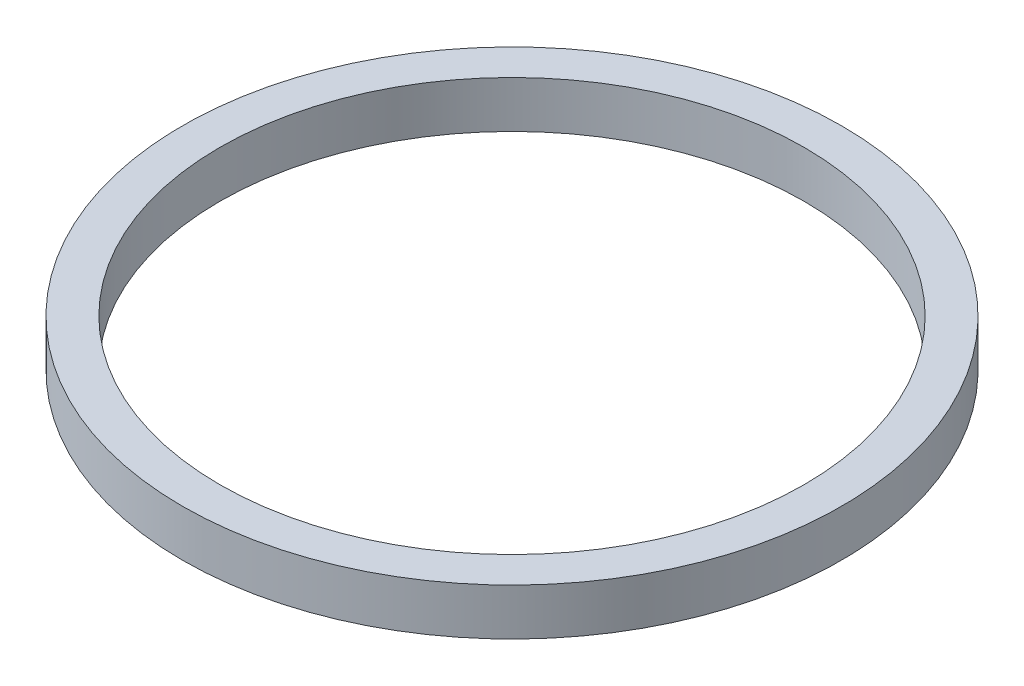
ISO-10303-21;
HEADER;
FILE_DESCRIPTION(('STEP AP214'),'2;1');
FILE_NAME('part.step','',(''),(''),'','','');
FILE_SCHEMA(('AUTOMOTIVE_DESIGN { 1 0 10303 214 1 1 1 1 }'));
ENDSEC;
DATA;
#1=APPLICATION_CONTEXT('core data for automotive mechanical design processes');
#2=APPLICATION_PROTOCOL_DEFINITION('international standard','automotive_design',2000,#1);
#3=PRODUCT_CONTEXT('',#1,'mechanical');
#4=PRODUCT('Part','Part','',(#3));
#5=PRODUCT_RELATED_PRODUCT_CATEGORY('part','',(#4));
#6=PRODUCT_DEFINITION_FORMATION('','',#4);
#7=PRODUCT_DEFINITION_CONTEXT('part definition',#1,'design');
#8=PRODUCT_DEFINITION('design','',#6,#7);
#9=PRODUCT_DEFINITION_SHAPE('','',#8);
#10=(LENGTH_UNIT() NAMED_UNIT(*) SI_UNIT(.MILLI.,.METRE.));
#11=(NAMED_UNIT(*) PLANE_ANGLE_UNIT() SI_UNIT($,.RADIAN.));
#12=(NAMED_UNIT(*) SI_UNIT($,.STERADIAN.) SOLID_ANGLE_UNIT());
#13=UNCERTAINTY_MEASURE_WITH_UNIT(LENGTH_MEASURE(1.E-05),#10,'distance_accuracy_value','');
#14=(GEOMETRIC_REPRESENTATION_CONTEXT(3) GLOBAL_UNCERTAINTY_ASSIGNED_CONTEXT((#13)) GLOBAL_UNIT_ASSIGNED_CONTEXT((#10,
#11,#12)) REPRESENTATION_CONTEXT('',''));
#15=CARTESIAN_POINT('',(0.,0.,0.));
#16=DIRECTION('',(0.,0.,1.));
#17=DIRECTION('',(1.,0.,0.));
#18=AXIS2_PLACEMENT_3D('',#15,#16,#17);
#19=CARTESIAN_POINT('',(0.,2.,0.));
#20=DIRECTION('',(0.,-1.,0.));
#21=DIRECTION('',(0.,0.,-1.));
#22=AXIS2_PLACEMENT_3D('',#19,#20,#21);
#23=CYLINDRICAL_SURFACE('',#22,14.1);
#24=CARTESIAN_POINT('',(0.,2.,0.));
#25=DIRECTION('',(0.,1.,0.));
#26=DIRECTION('',(0.,0.,1.));
#27=AXIS2_PLACEMENT_3D('',#24,#25,#26);
#28=CIRCLE('',#27,14.1);
#29=CARTESIAN_POINT('',(0.,2.,14.1));
#30=VERTEX_POINT('',#29);
#31=EDGE_CURVE('E10',#30,#30,#28,.T.);
#32=ORIENTED_EDGE('',*,*,#31,.F.);
#33=EDGE_LOOP('',(#32));
#34=FACE_BOUND('',#33,.T.);
#35=CARTESIAN_POINT('',(0.,0.,0.));
#36=DIRECTION('',(0.,1.,0.));
#37=DIRECTION('',(0.,0.,1.));
#38=AXIS2_PLACEMENT_3D('',#35,#36,#37);
#39=CIRCLE('',#38,14.1);
#40=CARTESIAN_POINT('',(0.,0.,14.1));
#41=VERTEX_POINT('',#40);
#42=EDGE_CURVE('E33',#41,#41,#39,.T.);
#43=ORIENTED_EDGE('',*,*,#42,.T.);
#44=EDGE_LOOP('',(#43));
#45=FACE_BOUND('',#44,.T.);
#46=ADVANCED_FACE('F30',(#34,#45),#23,.T.);
#47=CARTESIAN_POINT('',(0.,2.,0.));
#48=DIRECTION('',(0.,1.,0.));
#49=DIRECTION('',(0.,0.,1.));
#50=AXIS2_PLACEMENT_3D('',#47,#48,#49);
#51=PLANE('',#50);
#52=CARTESIAN_POINT('',(0.,2.,0.));
#53=DIRECTION('',(0.,1.,0.));
#54=DIRECTION('',(0.,0.,1.));
#55=AXIS2_PLACEMENT_3D('',#52,#53,#54);
#56=CIRCLE('',#55,12.5);
#57=CARTESIAN_POINT('',(0.,2.,12.5));
#58=VERTEX_POINT('',#57);
#59=EDGE_CURVE('E42',#58,#58,#56,.T.);
#60=ORIENTED_EDGE('',*,*,#59,.F.);
#61=EDGE_LOOP('',(#60));
#62=FACE_BOUND('',#61,.T.);
#63=ORIENTED_EDGE('',*,*,#31,.T.);
#64=EDGE_LOOP('',(#63));
#65=FACE_BOUND('',#64,.T.);
#66=ADVANCED_FACE('F57',(#62,#65),#51,.T.);
#67=CARTESIAN_POINT('',(0.,0.,0.));
#68=DIRECTION('',(0.,1.,0.));
#69=DIRECTION('',(0.,0.,1.));
#70=AXIS2_PLACEMENT_3D('',#67,#68,#69);
#71=PLANE('',#70);
#72=CARTESIAN_POINT('',(0.,0.,0.));
#73=DIRECTION('',(0.,1.,0.));
#74=DIRECTION('',(0.,0.,1.));
#75=AXIS2_PLACEMENT_3D('',#72,#73,#74);
#76=CIRCLE('',#75,12.5);
#77=CARTESIAN_POINT('',(0.,0.,12.5));
#78=VERTEX_POINT('',#77);
#79=EDGE_CURVE('E40',#78,#78,#76,.T.);
#80=ORIENTED_EDGE('',*,*,#79,.T.);
#81=EDGE_LOOP('',(#80));
#82=FACE_BOUND('',#81,.T.);
#83=ORIENTED_EDGE('',*,*,#42,.F.);
#84=EDGE_LOOP('',(#83));
#85=FACE_BOUND('',#84,.T.);
#86=ADVANCED_FACE('F48',(#82,#85),#71,.F.);
#87=CARTESIAN_POINT('',(0.,0.,0.));
#88=DIRECTION('',(0.,1.,0.));
#89=DIRECTION('',(0.,0.,1.));
#90=AXIS2_PLACEMENT_3D('',#87,#88,#89);
#91=CYLINDRICAL_SURFACE('',#90,12.5);
#92=ORIENTED_EDGE('',*,*,#79,.F.);
#93=EDGE_LOOP('',(#92));
#94=FACE_BOUND('',#93,.T.);
#95=ORIENTED_EDGE('',*,*,#59,.T.);
#96=EDGE_LOOP('',(#95));
#97=FACE_BOUND('',#96,.T.);
#98=ADVANCED_FACE('F51',(#94,#97),#91,.F.);
#99=CLOSED_SHELL('',(#46,#66,#86,#98));
#100=MANIFOLD_SOLID_BREP('B2',#99);
#101=ADVANCED_BREP_SHAPE_REPRESENTATION('',(#18,#100),#14);
#102=SHAPE_DEFINITION_REPRESENTATION(#9,#101);
ENDSEC;
END-ISO-10303-21;
